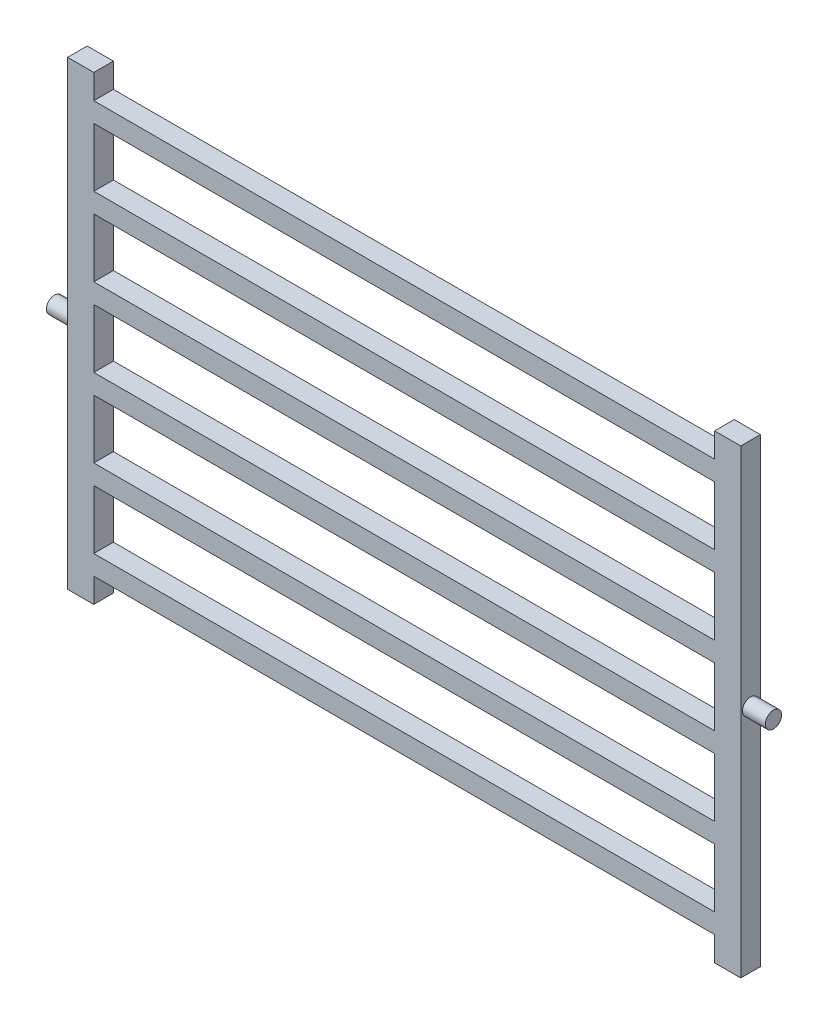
ISO-10303-21;
HEADER;
FILE_DESCRIPTION(('STEP AP214'),'2;1');
FILE_NAME('part.step','',(''),(''),'','','');
FILE_SCHEMA(('AUTOMOTIVE_DESIGN { 1 0 10303 214 1 1 1 1 }'));
ENDSEC;
DATA;
#1=APPLICATION_CONTEXT('core data for automotive mechanical design processes');
#2=APPLICATION_PROTOCOL_DEFINITION('international standard','automotive_design',2000,#1);
#3=PRODUCT_CONTEXT('',#1,'mechanical');
#4=PRODUCT('Part','Part','',(#3));
#5=PRODUCT_RELATED_PRODUCT_CATEGORY('part','',(#4));
#6=PRODUCT_DEFINITION_FORMATION('','',#4);
#7=PRODUCT_DEFINITION_CONTEXT('part definition',#1,'design');
#8=PRODUCT_DEFINITION('design','',#6,#7);
#9=PRODUCT_DEFINITION_SHAPE('','',#8);
#10=(LENGTH_UNIT() NAMED_UNIT(*) SI_UNIT(.MILLI.,.METRE.));
#11=(NAMED_UNIT(*) PLANE_ANGLE_UNIT() SI_UNIT($,.RADIAN.));
#12=(NAMED_UNIT(*) SI_UNIT($,.STERADIAN.) SOLID_ANGLE_UNIT());
#13=UNCERTAINTY_MEASURE_WITH_UNIT(LENGTH_MEASURE(1.E-05),#10,'distance_accuracy_value','');
#14=(GEOMETRIC_REPRESENTATION_CONTEXT(3) GLOBAL_UNCERTAINTY_ASSIGNED_CONTEXT((#13)) GLOBAL_UNIT_ASSIGNED_CONTEXT((#10,
#11,#12)) REPRESENTATION_CONTEXT('',''));
#15=CARTESIAN_POINT('',(0.,0.,0.));
#16=DIRECTION('',(0.,0.,1.));
#17=DIRECTION('',(1.,0.,0.));
#18=AXIS2_PLACEMENT_3D('',#15,#16,#17);
#19=CARTESIAN_POINT('',(205.,158.,8.));
#20=DIRECTION('',(1.,0.,0.));
#21=DIRECTION('',(0.,1.,0.));
#22=AXIS2_PLACEMENT_3D('',#19,#20,#21);
#23=PLANE('',#22);
#24=DIRECTION('',(0.,0.,-1.));
#25=VECTOR('',#24,1.);
#26=CARTESIAN_POINT('',(205.,150.5,8.));
#27=LINE('',#26,#25);
#28=CARTESIAN_POINT('',(205.,150.5,8.));
#29=VERTEX_POINT('',#28);
#30=CARTESIAN_POINT('',(205.,150.5,2.));
#31=VERTEX_POINT('',#30);
#32=EDGE_CURVE('E256',#29,#31,#27,.T.);
#33=ORIENTED_EDGE('',*,*,#32,.F.);
#34=DIRECTION('',(0.,-1.,0.));
#35=VECTOR('',#34,1.);
#36=CARTESIAN_POINT('',(205.,158.,8.));
#37=LINE('',#36,#35);
#38=CARTESIAN_POINT('',(205.,158.,8.));
#39=VERTEX_POINT('',#38);
#40=EDGE_CURVE('E492',#39,#29,#37,.T.);
#41=ORIENTED_EDGE('',*,*,#40,.F.);
#42=DIRECTION('',(0.,0.,-1.));
#43=VECTOR('',#42,1.);
#44=CARTESIAN_POINT('',(205.,158.,8.));
#45=LINE('',#44,#43);
#46=CARTESIAN_POINT('',(205.,158.,2.));
#47=VERTEX_POINT('',#46);
#48=EDGE_CURVE('E283',#39,#47,#45,.T.);
#49=ORIENTED_EDGE('',*,*,#48,.T.);
#50=DIRECTION('',(0.,-1.,0.));
#51=VECTOR('',#50,1.);
#52=CARTESIAN_POINT('',(205.,158.,2.));
#53=LINE('',#52,#51);
#54=EDGE_CURVE('E273',#47,#31,#53,.T.);
#55=ORIENTED_EDGE('',*,*,#54,.T.);
#56=EDGE_LOOP('',(#33,#41,#49,#55));
#57=FACE_BOUND('',#56,.T.);
#58=ADVANCED_FACE('F50',(#57),#23,.F.);
#59=CARTESIAN_POINT('',(15.,158.,8.));
#60=DIRECTION('',(-1.,0.,0.));
#61=DIRECTION('',(0.,-1.,0.));
#62=AXIS2_PLACEMENT_3D('',#59,#60,#61);
#63=PLANE('',#62);
#64=DIRECTION('',(0.,0.,-1.));
#65=VECTOR('',#64,1.);
#66=CARTESIAN_POINT('',(14.9999999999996,144.5,8.));
#67=LINE('',#66,#65);
#68=CARTESIAN_POINT('',(14.9999999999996,144.5,8.));
#69=VERTEX_POINT('',#68);
#70=CARTESIAN_POINT('',(14.9999999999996,144.5,2.));
#71=VERTEX_POINT('',#70);
#72=EDGE_CURVE('E452',#69,#71,#67,.T.);
#73=ORIENTED_EDGE('',*,*,#72,.F.);
#74=DIRECTION('',(0.,1.,0.));
#75=VECTOR('',#74,1.);
#76=CARTESIAN_POINT('',(15.,158.,8.));
#77=LINE('',#76,#75);
#78=CARTESIAN_POINT('',(14.9999999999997,126.5,8.));
#79=VERTEX_POINT('',#78);
#80=EDGE_CURVE('E651',#79,#69,#77,.T.);
#81=ORIENTED_EDGE('',*,*,#80,.F.);
#82=DIRECTION('',(0.,0.,-1.));
#83=VECTOR('',#82,1.);
#84=CARTESIAN_POINT('',(14.9999999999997,126.5,8.));
#85=LINE('',#84,#83);
#86=CARTESIAN_POINT('',(15.,126.5,2.));
#87=VERTEX_POINT('',#86);
#88=EDGE_CURVE('E423',#79,#87,#85,.T.);
#89=ORIENTED_EDGE('',*,*,#88,.T.);
#90=DIRECTION('',(0.,1.,0.));
#91=VECTOR('',#90,1.);
#92=CARTESIAN_POINT('',(15.,158.,2.));
#93=LINE('',#92,#91);
#94=EDGE_CURVE('E595',#87,#71,#93,.T.);
#95=ORIENTED_EDGE('',*,*,#94,.T.);
#96=EDGE_LOOP('',(#73,#81,#89,#95));
#97=FACE_BOUND('',#96,.T.);
#98=ADVANCED_FACE('F657',(#97),#63,.F.);
#99=CARTESIAN_POINT('',(205.,144.5,8.));
#100=VERTEX_POINT('',#99);
#101=CARTESIAN_POINT('',(205.,126.5,8.));
#102=VERTEX_POINT('',#101);
#103=EDGE_CURVE('E498',#100,#102,#37,.T.);
#104=ORIENTED_EDGE('',*,*,#103,.F.);
#105=DIRECTION('',(0.,0.,-1.));
#106=VECTOR('',#105,1.);
#107=CARTESIAN_POINT('',(205.,144.5,8.));
#108=LINE('',#107,#106);
#109=CARTESIAN_POINT('',(205.,144.5,2.));
#110=VERTEX_POINT('',#109);
#111=EDGE_CURVE('E270',#100,#110,#108,.T.);
#112=ORIENTED_EDGE('',*,*,#111,.T.);
#113=CARTESIAN_POINT('',(205.,126.5,2.));
#114=VERTEX_POINT('',#113);
#115=EDGE_CURVE('E289',#110,#114,#53,.T.);
#116=ORIENTED_EDGE('',*,*,#115,.T.);
#117=DIRECTION('',(0.,0.,-1.));
#118=VECTOR('',#117,1.);
#119=CARTESIAN_POINT('',(205.,126.5,8.));
#120=LINE('',#119,#118);
#121=EDGE_CURVE('E429',#102,#114,#120,.T.);
#122=ORIENTED_EDGE('',*,*,#121,.F.);
#123=EDGE_LOOP('',(#104,#112,#116,#122));
#124=FACE_BOUND('',#123,.T.);
#125=ADVANCED_FACE('F667',(#124),#23,.F.);
#126=DIRECTION('',(0.,0.,-1.));
#127=VECTOR('',#126,1.);
#128=CARTESIAN_POINT('',(14.9999999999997,120.5,8.));
#129=LINE('',#128,#127);
#130=CARTESIAN_POINT('',(14.9999999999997,120.5,8.));
#131=VERTEX_POINT('',#130);
#132=CARTESIAN_POINT('',(14.9999999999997,120.5,2.));
#133=VERTEX_POINT('',#132);
#134=EDGE_CURVE('E440',#131,#133,#129,.T.);
#135=ORIENTED_EDGE('',*,*,#134,.F.);
#136=CARTESIAN_POINT('',(14.9999999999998,102.5,8.));
#137=VERTEX_POINT('',#136);
#138=EDGE_CURVE('E647',#137,#131,#77,.T.);
#139=ORIENTED_EDGE('',*,*,#138,.F.);
#140=DIRECTION('',(0.,0.,-1.));
#141=VECTOR('',#140,1.);
#142=CARTESIAN_POINT('',(14.9999999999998,102.5,8.));
#143=LINE('',#142,#141);
#144=CARTESIAN_POINT('',(15.,102.5,2.));
#145=VERTEX_POINT('',#144);
#146=EDGE_CURVE('E393',#137,#145,#143,.T.);
#147=ORIENTED_EDGE('',*,*,#146,.T.);
#148=EDGE_CURVE('E597',#145,#133,#93,.T.);
#149=ORIENTED_EDGE('',*,*,#148,.T.);
#150=EDGE_LOOP('',(#135,#139,#147,#149));
#151=FACE_BOUND('',#150,.T.);
#152=ADVANCED_FACE('F701',(#151),#63,.F.);
#153=CARTESIAN_POINT('',(205.,120.5,8.));
#154=VERTEX_POINT('',#153);
#155=CARTESIAN_POINT('',(205.,102.5,8.));
#156=VERTEX_POINT('',#155);
#157=EDGE_CURVE('E669',#154,#156,#37,.T.);
#158=ORIENTED_EDGE('',*,*,#157,.F.);
#159=DIRECTION('',(0.,0.,-1.));
#160=VECTOR('',#159,1.);
#161=CARTESIAN_POINT('',(205.,120.5,8.));
#162=LINE('',#161,#160);
#163=CARTESIAN_POINT('',(205.,120.5,2.));
#164=VERTEX_POINT('',#163);
#165=EDGE_CURVE('E433',#154,#164,#162,.T.);
#166=ORIENTED_EDGE('',*,*,#165,.T.);
#167=CARTESIAN_POINT('',(205.,102.5,2.));
#168=VERTEX_POINT('',#167);
#169=EDGE_CURVE('E291',#164,#168,#53,.T.);
#170=ORIENTED_EDGE('',*,*,#169,.T.);
#171=DIRECTION('',(0.,0.,-1.));
#172=VECTOR('',#171,1.);
#173=CARTESIAN_POINT('',(205.,102.5,8.));
#174=LINE('',#173,#172);
#175=EDGE_CURVE('E402',#156,#168,#174,.T.);
#176=ORIENTED_EDGE('',*,*,#175,.F.);
#177=EDGE_LOOP('',(#158,#166,#170,#176));
#178=FACE_BOUND('',#177,.T.);
#179=ADVANCED_FACE('F703',(#178),#23,.F.);
#180=DIRECTION('',(0.,0.,-1.));
#181=VECTOR('',#180,1.);
#182=CARTESIAN_POINT('',(14.9999999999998,96.5,8.));
#183=LINE('',#182,#181);
#184=CARTESIAN_POINT('',(14.9999999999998,96.5,8.));
#185=VERTEX_POINT('',#184);
#186=CARTESIAN_POINT('',(14.9999999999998,96.5,2.));
#187=VERTEX_POINT('',#186);
#188=EDGE_CURVE('E406',#185,#187,#183,.T.);
#189=ORIENTED_EDGE('',*,*,#188,.F.);
#190=CARTESIAN_POINT('',(14.9999999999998,78.5,8.));
#191=VERTEX_POINT('',#190);
#192=EDGE_CURVE('E645',#191,#185,#77,.T.);
#193=ORIENTED_EDGE('',*,*,#192,.F.);
#194=DIRECTION('',(0.,0.,-1.));
#195=VECTOR('',#194,1.);
#196=CARTESIAN_POINT('',(14.9999999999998,78.5,8.));
#197=LINE('',#196,#195);
#198=CARTESIAN_POINT('',(15.,78.5,2.));
#199=VERTEX_POINT('',#198);
#200=EDGE_CURVE('E362',#191,#199,#197,.T.);
#201=ORIENTED_EDGE('',*,*,#200,.T.);
#202=EDGE_CURVE('E605',#199,#187,#93,.T.);
#203=ORIENTED_EDGE('',*,*,#202,.T.);
#204=EDGE_LOOP('',(#189,#193,#201,#203));
#205=FACE_BOUND('',#204,.T.);
#206=ADVANCED_FACE('F709',(#205),#63,.F.);
#207=CARTESIAN_POINT('',(205.,96.5,8.));
#208=VERTEX_POINT('',#207);
#209=CARTESIAN_POINT('',(205.,78.5,8.));
#210=VERTEX_POINT('',#209);
#211=EDGE_CURVE('E668',#208,#210,#37,.T.);
#212=ORIENTED_EDGE('',*,*,#211,.F.);
#213=DIRECTION('',(0.,0.,-1.));
#214=VECTOR('',#213,1.);
#215=CARTESIAN_POINT('',(205.,96.5,8.));
#216=LINE('',#215,#214);
#217=CARTESIAN_POINT('',(205.,96.5,2.));
#218=VERTEX_POINT('',#217);
#219=EDGE_CURVE('E403',#208,#218,#216,.T.);
#220=ORIENTED_EDGE('',*,*,#219,.T.);
#221=CARTESIAN_POINT('',(205.,78.5,2.));
#222=VERTEX_POINT('',#221);
#223=EDGE_CURVE('E809',#218,#222,#53,.T.);
#224=ORIENTED_EDGE('',*,*,#223,.T.);
#225=DIRECTION('',(0.,0.,-1.));
#226=VECTOR('',#225,1.);
#227=CARTESIAN_POINT('',(205.,78.5,8.));
#228=LINE('',#227,#226);
#229=EDGE_CURVE('E373',#210,#222,#228,.T.);
#230=ORIENTED_EDGE('',*,*,#229,.F.);
#231=EDGE_LOOP('',(#212,#220,#224,#230));
#232=FACE_BOUND('',#231,.T.);
#233=ADVANCED_FACE('F712',(#232),#23,.F.);
#234=DIRECTION('',(0.,0.,-1.));
#235=VECTOR('',#234,1.);
#236=CARTESIAN_POINT('',(14.9999999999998,72.5,8.));
#237=LINE('',#236,#235);
#238=CARTESIAN_POINT('',(14.9999999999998,72.5,8.));
#239=VERTEX_POINT('',#238);
#240=CARTESIAN_POINT('',(14.9999999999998,72.5,2.));
#241=VERTEX_POINT('',#240);
#242=EDGE_CURVE('E382',#239,#241,#237,.T.);
#243=ORIENTED_EDGE('',*,*,#242,.F.);
#244=CARTESIAN_POINT('',(14.9999999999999,54.5,8.));
#245=VERTEX_POINT('',#244);
#246=EDGE_CURVE('E638',#245,#239,#77,.T.);
#247=ORIENTED_EDGE('',*,*,#246,.F.);
#248=DIRECTION('',(0.,0.,-1.));
#249=VECTOR('',#248,1.);
#250=CARTESIAN_POINT('',(14.9999999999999,54.5,8.));
#251=LINE('',#250,#249);
#252=CARTESIAN_POINT('',(15.,54.5,2.));
#253=VERTEX_POINT('',#252);
#254=EDGE_CURVE('E340',#245,#253,#251,.T.);
#255=ORIENTED_EDGE('',*,*,#254,.T.);
#256=EDGE_CURVE('E608',#253,#241,#93,.T.);
#257=ORIENTED_EDGE('',*,*,#256,.T.);
#258=EDGE_LOOP('',(#243,#247,#255,#257));
#259=FACE_BOUND('',#258,.T.);
#260=ADVANCED_FACE('F713',(#259),#63,.F.);
#261=DIRECTION('',(0.,0.,-1.));
#262=VECTOR('',#261,1.);
#263=CARTESIAN_POINT('',(14.9999999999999,48.5,8.));
#264=LINE('',#263,#262);
#265=CARTESIAN_POINT('',(14.9999999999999,48.5,8.));
#266=VERTEX_POINT('',#265);
#267=CARTESIAN_POINT('',(14.9999999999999,48.5,2.));
#268=VERTEX_POINT('',#267);
#269=EDGE_CURVE('E355',#266,#268,#264,.T.);
#270=ORIENTED_EDGE('',*,*,#269,.F.);
#271=CARTESIAN_POINT('',(15.,30.5,8.));
#272=VERTEX_POINT('',#271);
#273=EDGE_CURVE('E536',#272,#266,#77,.T.);
#274=ORIENTED_EDGE('',*,*,#273,.F.);
#275=DIRECTION('',(0.,0.,-1.));
#276=VECTOR('',#275,1.);
#277=CARTESIAN_POINT('',(15.,30.5,8.));
#278=LINE('',#277,#276);
#279=CARTESIAN_POINT('',(15.,30.5,2.));
#280=VERTEX_POINT('',#279);
#281=EDGE_CURVE('E506',#272,#280,#278,.T.);
#282=ORIENTED_EDGE('',*,*,#281,.T.);
#283=EDGE_CURVE('E551',#280,#268,#93,.T.);
#284=ORIENTED_EDGE('',*,*,#283,.T.);
#285=EDGE_LOOP('',(#270,#274,#282,#284));
#286=FACE_BOUND('',#285,.T.);
#287=ADVANCED_FACE('F625',(#286),#63,.F.);
#288=CARTESIAN_POINT('',(205.,72.5,8.));
#289=VERTEX_POINT('',#288);
#290=CARTESIAN_POINT('',(205.,54.5,8.));
#291=VERTEX_POINT('',#290);
#292=EDGE_CURVE('E672',#289,#291,#37,.T.);
#293=ORIENTED_EDGE('',*,*,#292,.F.);
#294=DIRECTION('',(0.,0.,-1.));
#295=VECTOR('',#294,1.);
#296=CARTESIAN_POINT('',(205.,72.5,8.));
#297=LINE('',#296,#295);
#298=CARTESIAN_POINT('',(205.,72.5,2.));
#299=VERTEX_POINT('',#298);
#300=EDGE_CURVE('E380',#289,#299,#297,.T.);
#301=ORIENTED_EDGE('',*,*,#300,.T.);
#302=CARTESIAN_POINT('',(205.,54.5,2.));
#303=VERTEX_POINT('',#302);
#304=EDGE_CURVE('E304',#299,#303,#53,.T.);
#305=ORIENTED_EDGE('',*,*,#304,.T.);
#306=DIRECTION('',(0.,0.,-1.));
#307=VECTOR('',#306,1.);
#308=CARTESIAN_POINT('',(205.,54.5,8.));
#309=LINE('',#308,#307);
#310=EDGE_CURVE('E343',#291,#303,#309,.T.);
#311=ORIENTED_EDGE('',*,*,#310,.F.);
#312=EDGE_LOOP('',(#293,#301,#305,#311));
#313=FACE_BOUND('',#312,.T.);
#314=ADVANCED_FACE('F718',(#313),#23,.F.);
#315=DIRECTION('',(0.,0.,-1.));
#316=VECTOR('',#315,1.);
#317=CARTESIAN_POINT('',(15.,24.5,8.));
#318=LINE('',#317,#316);
#319=CARTESIAN_POINT('',(15.,24.5,8.));
#320=VERTEX_POINT('',#319);
#321=CARTESIAN_POINT('',(15.,24.5,2.));
#322=VERTEX_POINT('',#321);
#323=EDGE_CURVE('E518',#320,#322,#318,.T.);
#324=ORIENTED_EDGE('',*,*,#323,.F.);
#325=CARTESIAN_POINT('',(15.,17.,8.));
#326=VERTEX_POINT('',#325);
#327=EDGE_CURVE('E534',#326,#320,#77,.T.);
#328=ORIENTED_EDGE('',*,*,#327,.F.);
#329=DIRECTION('',(0.,0.,-1.));
#330=VECTOR('',#329,1.);
#331=CARTESIAN_POINT('',(15.,17.,8.));
#332=LINE('',#331,#330);
#333=CARTESIAN_POINT('',(15.,17.,2.));
#334=VERTEX_POINT('',#333);
#335=EDGE_CURVE('E565',#326,#334,#332,.T.);
#336=ORIENTED_EDGE('',*,*,#335,.T.);
#337=EDGE_CURVE('E548',#334,#322,#93,.T.);
#338=ORIENTED_EDGE('',*,*,#337,.T.);
#339=EDGE_LOOP('',(#324,#328,#336,#338));
#340=FACE_BOUND('',#339,.T.);
#341=ADVANCED_FACE('F576',(#340),#63,.F.);
#342=CARTESIAN_POINT('',(7.,158.,8.));
#343=DIRECTION('',(1.,0.,0.));
#344=DIRECTION('',(0.,0.,-1.));
#345=AXIS2_PLACEMENT_3D('',#342,#343,#344);
#346=PLANE('',#345);
#347=CARTESIAN_POINT('',(7.,87.5,5.));
#348=DIRECTION('',(-1.,0.,0.));
#349=DIRECTION('',(0.,0.,1.));
#350=AXIS2_PLACEMENT_3D('',#347,#348,#349);
#351=CIRCLE('',#350,2.5);
#352=CARTESIAN_POINT('',(7.,87.5,7.5));
#353=VERTEX_POINT('',#352);
#354=EDGE_CURVE('E60',#353,#353,#351,.T.);
#355=ORIENTED_EDGE('',*,*,#354,.F.);
#356=EDGE_LOOP('',(#355));
#357=FACE_BOUND('',#356,.T.);
#358=DIRECTION('',(0.,-1.,0.));
#359=VECTOR('',#358,1.);
#360=CARTESIAN_POINT('',(7.,158.,2.));
#361=LINE('',#360,#359);
#362=CARTESIAN_POINT('',(7.,158.,2.));
#363=VERTEX_POINT('',#362);
#364=CARTESIAN_POINT('',(7.,17.,2.));
#365=VERTEX_POINT('',#364);
#366=EDGE_CURVE('E522',#363,#365,#361,.T.);
#367=ORIENTED_EDGE('',*,*,#366,.T.);
#368=DIRECTION('',(0.,0.,-1.));
#369=VECTOR('',#368,1.);
#370=CARTESIAN_POINT('',(7.,17.,8.));
#371=LINE('',#370,#369);
#372=CARTESIAN_POINT('',(7.,17.,8.));
#373=VERTEX_POINT('',#372);
#374=EDGE_CURVE('E51',#373,#365,#371,.T.);
#375=ORIENTED_EDGE('',*,*,#374,.F.);
#376=DIRECTION('',(0.,-1.,0.));
#377=VECTOR('',#376,1.);
#378=CARTESIAN_POINT('',(7.,158.,8.));
#379=LINE('',#378,#377);
#380=CARTESIAN_POINT('',(7.,158.,8.));
#381=VERTEX_POINT('',#380);
#382=EDGE_CURVE('E524',#381,#373,#379,.T.);
#383=ORIENTED_EDGE('',*,*,#382,.F.);
#384=DIRECTION('',(0.,0.,-1.));
#385=VECTOR('',#384,1.);
#386=CARTESIAN_POINT('',(7.,158.,8.));
#387=LINE('',#386,#385);
#388=EDGE_CURVE('E545',#381,#363,#387,.T.);
#389=ORIENTED_EDGE('',*,*,#388,.T.);
#390=EDGE_LOOP('',(#367,#375,#383,#389));
#391=FACE_BOUND('',#390,.T.);
#392=ADVANCED_FACE('F47',(#357,#391),#346,.F.);
#393=CARTESIAN_POINT('',(7.,17.,8.));
#394=DIRECTION('',(0.,1.,0.));
#395=DIRECTION('',(0.,0.,1.));
#396=AXIS2_PLACEMENT_3D('',#393,#394,#395);
#397=PLANE('',#396);
#398=DIRECTION('',(1.,0.,0.));
#399=VECTOR('',#398,1.);
#400=CARTESIAN_POINT('',(7.,17.,2.));
#401=LINE('',#400,#399);
#402=EDGE_CURVE('E549',#365,#334,#401,.T.);
#403=ORIENTED_EDGE('',*,*,#402,.T.);
#404=ORIENTED_EDGE('',*,*,#335,.F.);
#405=DIRECTION('',(1.,0.,0.));
#406=VECTOR('',#405,1.);
#407=CARTESIAN_POINT('',(7.,17.,8.));
#408=LINE('',#407,#406);
#409=EDGE_CURVE('E528',#373,#326,#408,.T.);
#410=ORIENTED_EDGE('',*,*,#409,.F.);
#411=ORIENTED_EDGE('',*,*,#374,.T.);
#412=EDGE_LOOP('',(#403,#404,#410,#411));
#413=FACE_BOUND('',#412,.T.);
#414=ADVANCED_FACE('F572',(#413),#397,.F.);
#415=CARTESIAN_POINT('',(14.9999999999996,150.5,8.));
#416=VERTEX_POINT('',#415);
#417=CARTESIAN_POINT('',(15.,158.,8.));
#418=VERTEX_POINT('',#417);
#419=EDGE_CURVE('E531',#416,#418,#77,.T.);
#420=ORIENTED_EDGE('',*,*,#419,.F.);
#421=DIRECTION('',(0.,0.,-1.));
#422=VECTOR('',#421,1.);
#423=CARTESIAN_POINT('',(14.9999999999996,150.5,8.));
#424=LINE('',#423,#422);
#425=CARTESIAN_POINT('',(15.,150.5,2.));
#426=VERTEX_POINT('',#425);
#427=EDGE_CURVE('E266',#416,#426,#424,.T.);
#428=ORIENTED_EDGE('',*,*,#427,.T.);
#429=CARTESIAN_POINT('',(15.,158.,2.));
#430=VERTEX_POINT('',#429);
#431=EDGE_CURVE('E280',#426,#430,#93,.T.);
#432=ORIENTED_EDGE('',*,*,#431,.T.);
#433=DIRECTION('',(0.,0.,-1.));
#434=VECTOR('',#433,1.);
#435=CARTESIAN_POINT('',(15.,158.,8.));
#436=LINE('',#435,#434);
#437=EDGE_CURVE('E559',#418,#430,#436,.T.);
#438=ORIENTED_EDGE('',*,*,#437,.F.);
#439=EDGE_LOOP('',(#420,#428,#432,#438));
#440=FACE_BOUND('',#439,.T.);
#441=ADVANCED_FACE('F594',(#440),#63,.F.);
#442=CARTESIAN_POINT('',(7.,158.,8.));
#443=DIRECTION('',(0.,-1.,0.));
#444=DIRECTION('',(0.,0.,-1.));
#445=AXIS2_PLACEMENT_3D('',#442,#443,#444);
#446=PLANE('',#445);
#447=DIRECTION('',(-1.,0.,0.));
#448=VECTOR('',#447,1.);
#449=CARTESIAN_POINT('',(7.,158.,2.));
#450=LINE('',#449,#448);
#451=EDGE_CURVE('E527',#430,#363,#450,.T.);
#452=ORIENTED_EDGE('',*,*,#451,.T.);
#453=ORIENTED_EDGE('',*,*,#388,.F.);
#454=DIRECTION('',(-1.,0.,0.));
#455=VECTOR('',#454,1.);
#456=CARTESIAN_POINT('',(7.,158.,8.));
#457=LINE('',#456,#455);
#458=EDGE_CURVE('E539',#418,#381,#457,.T.);
#459=ORIENTED_EDGE('',*,*,#458,.F.);
#460=ORIENTED_EDGE('',*,*,#437,.T.);
#461=EDGE_LOOP('',(#452,#453,#459,#460));
#462=FACE_BOUND('',#461,.T.);
#463=ADVANCED_FACE('F587',(#462),#446,.F.);
#464=CARTESIAN_POINT('',(0.,0.,8.));
#465=DIRECTION('',(0.,0.,1.));
#466=DIRECTION('',(1.,0.,0.));
#467=AXIS2_PLACEMENT_3D('',#464,#465,#466);
#468=PLANE('',#467);
#469=ORIENTED_EDGE('',*,*,#40,.T.);
#470=DIRECTION('',(-1.,0.,0.));
#471=VECTOR('',#470,1.);
#472=CARTESIAN_POINT('',(14.9999999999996,150.5,8.));
#473=LINE('',#472,#471);
#474=EDGE_CURVE('E261',#29,#416,#473,.T.);
#475=ORIENTED_EDGE('',*,*,#474,.T.);
#476=ORIENTED_EDGE('',*,*,#419,.T.);
#477=ORIENTED_EDGE('',*,*,#458,.T.);
#478=ORIENTED_EDGE('',*,*,#382,.T.);
#479=ORIENTED_EDGE('',*,*,#409,.T.);
#480=ORIENTED_EDGE('',*,*,#327,.T.);
#481=DIRECTION('',(1.,0.,0.));
#482=VECTOR('',#481,1.);
#483=CARTESIAN_POINT('',(15.,24.5,8.));
#484=LINE('',#483,#482);
#485=CARTESIAN_POINT('',(205.,24.5,8.));
#486=VERTEX_POINT('',#485);
#487=EDGE_CURVE('E501',#320,#486,#484,.T.);
#488=ORIENTED_EDGE('',*,*,#487,.T.);
#489=CARTESIAN_POINT('',(205.,17.,8.));
#490=VERTEX_POINT('',#489);
#491=EDGE_CURVE('E494',#486,#490,#37,.T.);
#492=ORIENTED_EDGE('',*,*,#491,.T.);
#493=DIRECTION('',(1.,0.,0.));
#494=VECTOR('',#493,1.);
#495=CARTESIAN_POINT('',(213.,17.,8.));
#496=LINE('',#495,#494);
#497=CARTESIAN_POINT('',(213.,17.,8.));
#498=VERTEX_POINT('',#497);
#499=EDGE_CURVE('E316',#490,#498,#496,.T.);
#500=ORIENTED_EDGE('',*,*,#499,.T.);
#501=DIRECTION('',(0.,1.,0.));
#502=VECTOR('',#501,1.);
#503=CARTESIAN_POINT('',(213.,158.,8.));
#504=LINE('',#503,#502);
#505=CARTESIAN_POINT('',(213.,158.,8.));
#506=VERTEX_POINT('',#505);
#507=EDGE_CURVE('E306',#498,#506,#504,.T.);
#508=ORIENTED_EDGE('',*,*,#507,.T.);
#509=DIRECTION('',(-1.,0.,0.));
#510=VECTOR('',#509,1.);
#511=CARTESIAN_POINT('',(213.,158.,8.));
#512=LINE('',#511,#510);
#513=EDGE_CURVE('E312',#506,#39,#512,.T.);
#514=ORIENTED_EDGE('',*,*,#513,.T.);
#515=EDGE_LOOP('',(#469,#475,#476,#477,#478,#479,#480,#488,#492,#500,#508,#514));
#516=FACE_BOUND('',#515,.T.);
#517=DIRECTION('',(1.,0.,0.));
#518=VECTOR('',#517,1.);
#519=CARTESIAN_POINT('',(14.9999999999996,144.5,8.));
#520=LINE('',#519,#518);
#521=EDGE_CURVE('E276',#69,#100,#520,.T.);
#522=ORIENTED_EDGE('',*,*,#521,.T.);
#523=ORIENTED_EDGE('',*,*,#103,.T.);
#524=DIRECTION('',(-1.,0.,0.));
#525=VECTOR('',#524,1.);
#526=CARTESIAN_POINT('',(14.9999999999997,126.5,8.));
#527=LINE('',#526,#525);
#528=EDGE_CURVE('E420',#102,#79,#527,.T.);
#529=ORIENTED_EDGE('',*,*,#528,.T.);
#530=ORIENTED_EDGE('',*,*,#80,.T.);
#531=EDGE_LOOP('',(#522,#523,#529,#530));
#532=FACE_BOUND('',#531,.T.);
#533=DIRECTION('',(1.,0.,0.));
#534=VECTOR('',#533,1.);
#535=CARTESIAN_POINT('',(14.9999999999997,120.5,8.));
#536=LINE('',#535,#534);
#537=EDGE_CURVE('E412',#131,#154,#536,.T.);
#538=ORIENTED_EDGE('',*,*,#537,.T.);
#539=ORIENTED_EDGE('',*,*,#157,.T.);
#540=DIRECTION('',(-1.,0.,0.));
#541=VECTOR('',#540,1.);
#542=CARTESIAN_POINT('',(14.9999999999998,102.5,8.));
#543=LINE('',#542,#541);
#544=EDGE_CURVE('E388',#156,#137,#543,.T.);
#545=ORIENTED_EDGE('',*,*,#544,.T.);
#546=ORIENTED_EDGE('',*,*,#138,.T.);
#547=EDGE_LOOP('',(#538,#539,#545,#546));
#548=FACE_BOUND('',#547,.T.);
#549=DIRECTION('',(1.,0.,0.));
#550=VECTOR('',#549,1.);
#551=CARTESIAN_POINT('',(14.9999999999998,96.5,8.));
#552=LINE('',#551,#550);
#553=EDGE_CURVE('E387',#185,#208,#552,.T.);
#554=ORIENTED_EDGE('',*,*,#553,.T.);
#555=ORIENTED_EDGE('',*,*,#211,.T.);
#556=DIRECTION('',(-1.,0.,0.));
#557=VECTOR('',#556,1.);
#558=CARTESIAN_POINT('',(14.9999999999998,78.5,8.));
#559=LINE('',#558,#557);
#560=EDGE_CURVE('E365',#210,#191,#559,.T.);
#561=ORIENTED_EDGE('',*,*,#560,.T.);
#562=ORIENTED_EDGE('',*,*,#192,.T.);
#563=EDGE_LOOP('',(#554,#555,#561,#562));
#564=FACE_BOUND('',#563,.T.);
#565=ORIENTED_EDGE('',*,*,#273,.T.);
#566=DIRECTION('',(1.,0.,0.));
#567=VECTOR('',#566,1.);
#568=CARTESIAN_POINT('',(14.9999999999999,48.5,8.));
#569=LINE('',#568,#567);
#570=CARTESIAN_POINT('',(205.,48.5,8.));
#571=VERTEX_POINT('',#570);
#572=EDGE_CURVE('E329',#266,#571,#569,.T.);
#573=ORIENTED_EDGE('',*,*,#572,.T.);
#574=CARTESIAN_POINT('',(205.,30.5,8.));
#575=VERTEX_POINT('',#574);
#576=EDGE_CURVE('E636',#571,#575,#37,.T.);
#577=ORIENTED_EDGE('',*,*,#576,.T.);
#578=DIRECTION('',(-1.,0.,0.));
#579=VECTOR('',#578,1.);
#580=CARTESIAN_POINT('',(15.,30.5,8.));
#581=LINE('',#580,#579);
#582=EDGE_CURVE('E502',#575,#272,#581,.T.);
#583=ORIENTED_EDGE('',*,*,#582,.T.);
#584=EDGE_LOOP('',(#565,#573,#577,#583));
#585=FACE_BOUND('',#584,.T.);
#586=DIRECTION('',(1.,0.,0.));
#587=VECTOR('',#586,1.);
#588=CARTESIAN_POINT('',(14.9999999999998,72.5,8.));
#589=LINE('',#588,#587);
#590=EDGE_CURVE('E356',#239,#289,#589,.T.);
#591=ORIENTED_EDGE('',*,*,#590,.T.);
#592=ORIENTED_EDGE('',*,*,#292,.T.);
#593=DIRECTION('',(-1.,0.,0.));
#594=VECTOR('',#593,1.);
#595=CARTESIAN_POINT('',(14.9999999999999,54.5,8.));
#596=LINE('',#595,#594);
#597=EDGE_CURVE('E333',#291,#245,#596,.T.);
#598=ORIENTED_EDGE('',*,*,#597,.T.);
#599=ORIENTED_EDGE('',*,*,#246,.T.);
#600=EDGE_LOOP('',(#591,#592,#598,#599));
#601=FACE_BOUND('',#600,.T.);
#602=ADVANCED_FACE('F585',(#516,#532,#548,#564,#585,#601),#468,.T.);
#603=CARTESIAN_POINT('',(0.,0.,2.));
#604=DIRECTION('',(0.,0.,1.));
#605=DIRECTION('',(1.,0.,0.));
#606=AXIS2_PLACEMENT_3D('',#603,#604,#605);
#607=PLANE('',#606);
#608=DIRECTION('',(-1.,0.,0.));
#609=VECTOR('',#608,1.);
#610=CARTESIAN_POINT('',(14.9999999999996,150.5,2.));
#611=LINE('',#610,#609);
#612=EDGE_CURVE('E63',#31,#426,#611,.T.);
#613=ORIENTED_EDGE('',*,*,#612,.F.);
#614=ORIENTED_EDGE('',*,*,#54,.F.);
#615=DIRECTION('',(-1.,0.,0.));
#616=VECTOR('',#615,1.);
#617=CARTESIAN_POINT('',(213.,158.,2.));
#618=LINE('',#617,#616);
#619=CARTESIAN_POINT('',(213.,158.,2.));
#620=VERTEX_POINT('',#619);
#621=EDGE_CURVE('E284',#620,#47,#618,.T.);
#622=ORIENTED_EDGE('',*,*,#621,.F.);
#623=DIRECTION('',(0.,1.,0.));
#624=VECTOR('',#623,1.);
#625=CARTESIAN_POINT('',(213.,158.,2.));
#626=LINE('',#625,#624);
#627=CARTESIAN_POINT('',(213.,17.,2.));
#628=VERTEX_POINT('',#627);
#629=EDGE_CURVE('E293',#628,#620,#626,.T.);
#630=ORIENTED_EDGE('',*,*,#629,.F.);
#631=DIRECTION('',(1.,0.,0.));
#632=VECTOR('',#631,1.);
#633=CARTESIAN_POINT('',(213.,17.,2.));
#634=LINE('',#633,#632);
#635=CARTESIAN_POINT('',(205.,17.,2.));
#636=VERTEX_POINT('',#635);
#637=EDGE_CURVE('E300',#636,#628,#634,.T.);
#638=ORIENTED_EDGE('',*,*,#637,.F.);
#639=CARTESIAN_POINT('',(205.,24.5,2.));
#640=VERTEX_POINT('',#639);
#641=EDGE_CURVE('E290',#640,#636,#53,.T.);
#642=ORIENTED_EDGE('',*,*,#641,.F.);
#643=DIRECTION('',(1.,0.,0.));
#644=VECTOR('',#643,1.);
#645=CARTESIAN_POINT('',(15.,24.5,2.));
#646=LINE('',#645,#644);
#647=EDGE_CURVE('E488',#322,#640,#646,.T.);
#648=ORIENTED_EDGE('',*,*,#647,.F.);
#649=ORIENTED_EDGE('',*,*,#337,.F.);
#650=ORIENTED_EDGE('',*,*,#402,.F.);
#651=ORIENTED_EDGE('',*,*,#366,.F.);
#652=ORIENTED_EDGE('',*,*,#451,.F.);
#653=ORIENTED_EDGE('',*,*,#431,.F.);
#654=EDGE_LOOP('',(#613,#614,#622,#630,#638,#642,#648,#649,#650,#651,#652,#653));
#655=FACE_BOUND('',#654,.T.);
#656=DIRECTION('',(-1.,0.,0.));
#657=VECTOR('',#656,1.);
#658=CARTESIAN_POINT('',(14.9999999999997,126.5,2.));
#659=LINE('',#658,#657);
#660=EDGE_CURVE('E416',#114,#87,#659,.T.);
#661=ORIENTED_EDGE('',*,*,#660,.F.);
#662=ORIENTED_EDGE('',*,*,#115,.F.);
#663=DIRECTION('',(1.,0.,0.));
#664=VECTOR('',#663,1.);
#665=CARTESIAN_POINT('',(14.9999999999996,144.5,2.));
#666=LINE('',#665,#664);
#667=EDGE_CURVE('E75',#71,#110,#666,.T.);
#668=ORIENTED_EDGE('',*,*,#667,.F.);
#669=ORIENTED_EDGE('',*,*,#94,.F.);
#670=EDGE_LOOP('',(#661,#662,#668,#669));
#671=FACE_BOUND('',#670,.T.);
#672=DIRECTION('',(-1.,0.,0.));
#673=VECTOR('',#672,1.);
#674=CARTESIAN_POINT('',(14.9999999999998,102.5,2.));
#675=LINE('',#674,#673);
#676=EDGE_CURVE('E386',#168,#145,#675,.T.);
#677=ORIENTED_EDGE('',*,*,#676,.F.);
#678=ORIENTED_EDGE('',*,*,#169,.F.);
#679=DIRECTION('',(1.,0.,0.));
#680=VECTOR('',#679,1.);
#681=CARTESIAN_POINT('',(14.9999999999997,120.5,2.));
#682=LINE('',#681,#680);
#683=EDGE_CURVE('E413',#133,#164,#682,.T.);
#684=ORIENTED_EDGE('',*,*,#683,.F.);
#685=ORIENTED_EDGE('',*,*,#148,.F.);
#686=EDGE_LOOP('',(#677,#678,#684,#685));
#687=FACE_BOUND('',#686,.T.);
#688=DIRECTION('',(-1.,0.,0.));
#689=VECTOR('',#688,1.);
#690=CARTESIAN_POINT('',(14.9999999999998,78.5,2.));
#691=LINE('',#690,#689);
#692=EDGE_CURVE('E363',#222,#199,#691,.T.);
#693=ORIENTED_EDGE('',*,*,#692,.F.);
#694=ORIENTED_EDGE('',*,*,#223,.F.);
#695=DIRECTION('',(1.,0.,0.));
#696=VECTOR('',#695,1.);
#697=CARTESIAN_POINT('',(14.9999999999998,96.5,2.));
#698=LINE('',#697,#696);
#699=EDGE_CURVE('E383',#187,#218,#698,.T.);
#700=ORIENTED_EDGE('',*,*,#699,.F.);
#701=ORIENTED_EDGE('',*,*,#202,.F.);
#702=EDGE_LOOP('',(#693,#694,#700,#701));
#703=FACE_BOUND('',#702,.T.);
#704=DIRECTION('',(1.,0.,0.));
#705=VECTOR('',#704,1.);
#706=CARTESIAN_POINT('',(14.9999999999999,48.5,2.));
#707=LINE('',#706,#705);
#708=CARTESIAN_POINT('',(205.,48.5,2.));
#709=VERTEX_POINT('',#708);
#710=EDGE_CURVE('E327',#268,#709,#707,.T.);
#711=ORIENTED_EDGE('',*,*,#710,.F.);
#712=ORIENTED_EDGE('',*,*,#283,.F.);
#713=DIRECTION('',(-1.,0.,0.));
#714=VECTOR('',#713,1.);
#715=CARTESIAN_POINT('',(15.,30.5,2.));
#716=LINE('',#715,#714);
#717=CARTESIAN_POINT('',(205.,30.5,2.));
#718=VERTEX_POINT('',#717);
#719=EDGE_CURVE('E490',#718,#280,#716,.T.);
#720=ORIENTED_EDGE('',*,*,#719,.F.);
#721=EDGE_CURVE('E298',#709,#718,#53,.T.);
#722=ORIENTED_EDGE('',*,*,#721,.F.);
#723=EDGE_LOOP('',(#711,#712,#720,#722));
#724=FACE_BOUND('',#723,.T.);
#725=ORIENTED_EDGE('',*,*,#304,.F.);
#726=DIRECTION('',(1.,0.,0.));
#727=VECTOR('',#726,1.);
#728=CARTESIAN_POINT('',(14.9999999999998,72.5,2.));
#729=LINE('',#728,#727);
#730=EDGE_CURVE('E357',#241,#299,#729,.T.);
#731=ORIENTED_EDGE('',*,*,#730,.F.);
#732=ORIENTED_EDGE('',*,*,#256,.F.);
#733=DIRECTION('',(-1.,0.,0.));
#734=VECTOR('',#733,1.);
#735=CARTESIAN_POINT('',(14.9999999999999,54.5,2.));
#736=LINE('',#735,#734);
#737=EDGE_CURVE('E335',#303,#253,#736,.T.);
#738=ORIENTED_EDGE('',*,*,#737,.F.);
#739=EDGE_LOOP('',(#725,#731,#732,#738));
#740=FACE_BOUND('',#739,.T.);
#741=ADVANCED_FACE('F271',(#655,#671,#687,#703,#724,#740),#607,.F.);
#742=CARTESIAN_POINT('',(15.,24.5,8.));
#743=DIRECTION('',(0.,1.,0.));
#744=DIRECTION('',(0.,0.,1.));
#745=AXIS2_PLACEMENT_3D('',#742,#743,#744);
#746=PLANE('',#745);
#747=ORIENTED_EDGE('',*,*,#647,.T.);
#748=DIRECTION('',(0.,0.,-1.));
#749=VECTOR('',#748,1.);
#750=CARTESIAN_POINT('',(205.,24.5,8.));
#751=LINE('',#750,#749);
#752=EDGE_CURVE('E520',#486,#640,#751,.T.);
#753=ORIENTED_EDGE('',*,*,#752,.F.);
#754=ORIENTED_EDGE('',*,*,#487,.F.);
#755=ORIENTED_EDGE('',*,*,#323,.T.);
#756=EDGE_LOOP('',(#747,#753,#754,#755));
#757=FACE_BOUND('',#756,.T.);
#758=ADVANCED_FACE('F735',(#757),#746,.F.);
#759=CARTESIAN_POINT('',(15.,30.5,8.));
#760=DIRECTION('',(0.,-1.,0.));
#761=DIRECTION('',(0.,0.,-1.));
#762=AXIS2_PLACEMENT_3D('',#759,#760,#761);
#763=PLANE('',#762);
#764=ORIENTED_EDGE('',*,*,#719,.T.);
#765=ORIENTED_EDGE('',*,*,#281,.F.);
#766=ORIENTED_EDGE('',*,*,#582,.F.);
#767=DIRECTION('',(0.,0.,-1.));
#768=VECTOR('',#767,1.);
#769=CARTESIAN_POINT('',(205.,30.5,8.));
#770=LINE('',#769,#768);
#771=EDGE_CURVE('E514',#575,#718,#770,.T.);
#772=ORIENTED_EDGE('',*,*,#771,.T.);
#773=EDGE_LOOP('',(#764,#765,#766,#772));
#774=FACE_BOUND('',#773,.T.);
#775=ADVANCED_FACE('F726',(#774),#763,.F.);
#776=ORIENTED_EDGE('',*,*,#491,.F.);
#777=ORIENTED_EDGE('',*,*,#752,.T.);
#778=ORIENTED_EDGE('',*,*,#641,.T.);
#779=DIRECTION('',(0.,0.,-1.));
#780=VECTOR('',#779,1.);
#781=CARTESIAN_POINT('',(205.,17.,8.));
#782=LINE('',#781,#780);
#783=EDGE_CURVE('E318',#490,#636,#782,.T.);
#784=ORIENTED_EDGE('',*,*,#783,.F.);
#785=EDGE_LOOP('',(#776,#777,#778,#784));
#786=FACE_BOUND('',#785,.T.);
#787=ADVANCED_FACE('F477',(#786),#23,.F.);
#788=CARTESIAN_POINT('',(213.,158.,8.));
#789=DIRECTION('',(-1.,0.,0.));
#790=DIRECTION('',(0.,-1.,0.));
#791=AXIS2_PLACEMENT_3D('',#788,#789,#790);
#792=PLANE('',#791);
#793=CARTESIAN_POINT('',(213.,87.5,5.));
#794=DIRECTION('',(1.,0.,0.));
#795=DIRECTION('',(0.,1.,0.));
#796=AXIS2_PLACEMENT_3D('',#793,#794,#795);
#797=CIRCLE('',#796,2.5);
#798=CARTESIAN_POINT('',(213.,90.,5.));
#799=VERTEX_POINT('',#798);
#800=EDGE_CURVE('E11',#799,#799,#797,.T.);
#801=ORIENTED_EDGE('',*,*,#800,.F.);
#802=EDGE_LOOP('',(#801));
#803=FACE_BOUND('',#802,.T.);
#804=ORIENTED_EDGE('',*,*,#629,.T.);
#805=DIRECTION('',(0.,0.,-1.));
#806=VECTOR('',#805,1.);
#807=CARTESIAN_POINT('',(213.,158.,8.));
#808=LINE('',#807,#806);
#809=EDGE_CURVE('E323',#506,#620,#808,.T.);
#810=ORIENTED_EDGE('',*,*,#809,.F.);
#811=ORIENTED_EDGE('',*,*,#507,.F.);
#812=DIRECTION('',(0.,0.,-1.));
#813=VECTOR('',#812,1.);
#814=CARTESIAN_POINT('',(213.,17.,8.));
#815=LINE('',#814,#813);
#816=EDGE_CURVE('E317',#498,#628,#815,.T.);
#817=ORIENTED_EDGE('',*,*,#816,.T.);
#818=EDGE_LOOP('',(#804,#810,#811,#817));
#819=FACE_BOUND('',#818,.T.);
#820=ADVANCED_FACE('F473',(#803,#819),#792,.F.);
#821=CARTESIAN_POINT('',(213.,158.,8.));
#822=DIRECTION('',(0.,-1.,0.));
#823=DIRECTION('',(0.,0.,-1.));
#824=AXIS2_PLACEMENT_3D('',#821,#822,#823);
#825=PLANE('',#824);
#826=ORIENTED_EDGE('',*,*,#621,.T.);
#827=ORIENTED_EDGE('',*,*,#48,.F.);
#828=ORIENTED_EDGE('',*,*,#513,.F.);
#829=ORIENTED_EDGE('',*,*,#809,.T.);
#830=EDGE_LOOP('',(#826,#827,#828,#829));
#831=FACE_BOUND('',#830,.T.);
#832=ADVANCED_FACE('F478',(#831),#825,.F.);
#833=ORIENTED_EDGE('',*,*,#576,.F.);
#834=DIRECTION('',(0.,0.,-1.));
#835=VECTOR('',#834,1.);
#836=CARTESIAN_POINT('',(205.,48.5,8.));
#837=LINE('',#836,#835);
#838=EDGE_CURVE('E347',#571,#709,#837,.T.);
#839=ORIENTED_EDGE('',*,*,#838,.T.);
#840=ORIENTED_EDGE('',*,*,#721,.T.);
#841=ORIENTED_EDGE('',*,*,#771,.F.);
#842=EDGE_LOOP('',(#833,#839,#840,#841));
#843=FACE_BOUND('',#842,.T.);
#844=ADVANCED_FACE('F690',(#843),#23,.F.);
#845=CARTESIAN_POINT('',(213.,17.,8.));
#846=DIRECTION('',(0.,1.,0.));
#847=DIRECTION('',(-1.,0.,0.));
#848=AXIS2_PLACEMENT_3D('',#845,#846,#847);
#849=PLANE('',#848);
#850=ORIENTED_EDGE('',*,*,#637,.T.);
#851=ORIENTED_EDGE('',*,*,#816,.F.);
#852=ORIENTED_EDGE('',*,*,#499,.F.);
#853=ORIENTED_EDGE('',*,*,#783,.T.);
#854=EDGE_LOOP('',(#850,#851,#852,#853));
#855=FACE_BOUND('',#854,.T.);
#856=ADVANCED_FACE('F685',(#855),#849,.F.);
#857=CARTESIAN_POINT('',(14.9999999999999,48.5,8.));
#858=DIRECTION('',(0.,1.,0.));
#859=DIRECTION('',(0.,0.,1.));
#860=AXIS2_PLACEMENT_3D('',#857,#858,#859);
#861=PLANE('',#860);
#862=ORIENTED_EDGE('',*,*,#710,.T.);
#863=ORIENTED_EDGE('',*,*,#838,.F.);
#864=ORIENTED_EDGE('',*,*,#572,.F.);
#865=ORIENTED_EDGE('',*,*,#269,.T.);
#866=EDGE_LOOP('',(#862,#863,#864,#865));
#867=FACE_BOUND('',#866,.T.);
#868=ADVANCED_FACE('F635',(#867),#861,.F.);
#869=CARTESIAN_POINT('',(14.9999999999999,54.5,8.));
#870=DIRECTION('',(0.,-1.,0.));
#871=DIRECTION('',(0.,0.,-1.));
#872=AXIS2_PLACEMENT_3D('',#869,#870,#871);
#873=PLANE('',#872);
#874=ORIENTED_EDGE('',*,*,#737,.T.);
#875=ORIENTED_EDGE('',*,*,#254,.F.);
#876=ORIENTED_EDGE('',*,*,#597,.F.);
#877=ORIENTED_EDGE('',*,*,#310,.T.);
#878=EDGE_LOOP('',(#874,#875,#876,#877));
#879=FACE_BOUND('',#878,.T.);
#880=ADVANCED_FACE('F788',(#879),#873,.F.);
#881=CARTESIAN_POINT('',(14.9999999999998,72.5,8.));
#882=DIRECTION('',(0.,1.,0.));
#883=DIRECTION('',(0.,0.,1.));
#884=AXIS2_PLACEMENT_3D('',#881,#882,#883);
#885=PLANE('',#884);
#886=ORIENTED_EDGE('',*,*,#730,.T.);
#887=ORIENTED_EDGE('',*,*,#300,.F.);
#888=ORIENTED_EDGE('',*,*,#590,.F.);
#889=ORIENTED_EDGE('',*,*,#242,.T.);
#890=EDGE_LOOP('',(#886,#887,#888,#889));
#891=FACE_BOUND('',#890,.T.);
#892=ADVANCED_FACE('F789',(#891),#885,.F.);
#893=CARTESIAN_POINT('',(14.9999999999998,78.5,8.));
#894=DIRECTION('',(0.,-1.,0.));
#895=DIRECTION('',(0.,0.,-1.));
#896=AXIS2_PLACEMENT_3D('',#893,#894,#895);
#897=PLANE('',#896);
#898=ORIENTED_EDGE('',*,*,#692,.T.);
#899=ORIENTED_EDGE('',*,*,#200,.F.);
#900=ORIENTED_EDGE('',*,*,#560,.F.);
#901=ORIENTED_EDGE('',*,*,#229,.T.);
#902=EDGE_LOOP('',(#898,#899,#900,#901));
#903=FACE_BOUND('',#902,.T.);
#904=ADVANCED_FACE('F781',(#903),#897,.F.);
#905=CARTESIAN_POINT('',(14.9999999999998,96.5,8.));
#906=DIRECTION('',(0.,1.,0.));
#907=DIRECTION('',(0.,0.,1.));
#908=AXIS2_PLACEMENT_3D('',#905,#906,#907);
#909=PLANE('',#908);
#910=ORIENTED_EDGE('',*,*,#699,.T.);
#911=ORIENTED_EDGE('',*,*,#219,.F.);
#912=ORIENTED_EDGE('',*,*,#553,.F.);
#913=ORIENTED_EDGE('',*,*,#188,.T.);
#914=EDGE_LOOP('',(#910,#911,#912,#913));
#915=FACE_BOUND('',#914,.T.);
#916=ADVANCED_FACE('F779',(#915),#909,.F.);
#917=CARTESIAN_POINT('',(14.9999999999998,102.5,8.));
#918=DIRECTION('',(0.,-1.,0.));
#919=DIRECTION('',(0.,0.,-1.));
#920=AXIS2_PLACEMENT_3D('',#917,#918,#919);
#921=PLANE('',#920);
#922=ORIENTED_EDGE('',*,*,#676,.T.);
#923=ORIENTED_EDGE('',*,*,#146,.F.);
#924=ORIENTED_EDGE('',*,*,#544,.F.);
#925=ORIENTED_EDGE('',*,*,#175,.T.);
#926=EDGE_LOOP('',(#922,#923,#924,#925));
#927=FACE_BOUND('',#926,.T.);
#928=ADVANCED_FACE('F774',(#927),#921,.F.);
#929=CARTESIAN_POINT('',(14.9999999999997,120.5,8.));
#930=DIRECTION('',(0.,1.,0.));
#931=DIRECTION('',(0.,0.,1.));
#932=AXIS2_PLACEMENT_3D('',#929,#930,#931);
#933=PLANE('',#932);
#934=ORIENTED_EDGE('',*,*,#683,.T.);
#935=ORIENTED_EDGE('',*,*,#165,.F.);
#936=ORIENTED_EDGE('',*,*,#537,.F.);
#937=ORIENTED_EDGE('',*,*,#134,.T.);
#938=EDGE_LOOP('',(#934,#935,#936,#937));
#939=FACE_BOUND('',#938,.T.);
#940=ADVANCED_FACE('F769',(#939),#933,.F.);
#941=CARTESIAN_POINT('',(14.9999999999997,126.5,8.));
#942=DIRECTION('',(0.,-1.,0.));
#943=DIRECTION('',(0.,0.,-1.));
#944=AXIS2_PLACEMENT_3D('',#941,#942,#943);
#945=PLANE('',#944);
#946=ORIENTED_EDGE('',*,*,#660,.T.);
#947=ORIENTED_EDGE('',*,*,#88,.F.);
#948=ORIENTED_EDGE('',*,*,#528,.F.);
#949=ORIENTED_EDGE('',*,*,#121,.T.);
#950=EDGE_LOOP('',(#946,#947,#948,#949));
#951=FACE_BOUND('',#950,.T.);
#952=ADVANCED_FACE('F767',(#951),#945,.F.);
#953=CARTESIAN_POINT('',(14.9999999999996,144.5,8.));
#954=DIRECTION('',(0.,1.,0.));
#955=DIRECTION('',(0.,0.,1.));
#956=AXIS2_PLACEMENT_3D('',#953,#954,#955);
#957=PLANE('',#956);
#958=ORIENTED_EDGE('',*,*,#667,.T.);
#959=ORIENTED_EDGE('',*,*,#111,.F.);
#960=ORIENTED_EDGE('',*,*,#521,.F.);
#961=ORIENTED_EDGE('',*,*,#72,.T.);
#962=EDGE_LOOP('',(#958,#959,#960,#961));
#963=FACE_BOUND('',#962,.T.);
#964=ADVANCED_FACE('F662',(#963),#957,.F.);
#965=CARTESIAN_POINT('',(14.9999999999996,150.5,8.));
#966=DIRECTION('',(0.,-1.,0.));
#967=DIRECTION('',(0.,0.,-1.));
#968=AXIS2_PLACEMENT_3D('',#965,#966,#967);
#969=PLANE('',#968);
#970=ORIENTED_EDGE('',*,*,#612,.T.);
#971=ORIENTED_EDGE('',*,*,#427,.F.);
#972=ORIENTED_EDGE('',*,*,#474,.F.);
#973=ORIENTED_EDGE('',*,*,#32,.T.);
#974=EDGE_LOOP('',(#970,#971,#972,#973));
#975=FACE_BOUND('',#974,.T.);
#976=ADVANCED_FACE('F258',(#975),#969,.F.);
#977=CARTESIAN_POINT('',(0.,87.5,5.));
#978=DIRECTION('',(1.,0.,0.));
#979=DIRECTION('',(0.,0.,-1.));
#980=AXIS2_PLACEMENT_3D('',#977,#978,#979);
#981=CYLINDRICAL_SURFACE('',#980,2.5);
#982=CARTESIAN_POINT('',(0.,87.5,5.));
#983=DIRECTION('',(-1.,0.,0.));
#984=DIRECTION('',(0.,0.,1.));
#985=AXIS2_PLACEMENT_3D('',#982,#983,#984);
#986=CIRCLE('',#985,2.5);
#987=CARTESIAN_POINT('',(0.,87.5,7.5));
#988=VERTEX_POINT('',#987);
#989=EDGE_CURVE('E451',#988,#988,#986,.T.);
#990=ORIENTED_EDGE('',*,*,#989,.F.);
#991=EDGE_LOOP('',(#990));
#992=FACE_BOUND('',#991,.T.);
#993=ORIENTED_EDGE('',*,*,#354,.T.);
#994=EDGE_LOOP('',(#993));
#995=FACE_BOUND('',#994,.T.);
#996=ADVANCED_FACE('F756',(#992,#995),#981,.T.);
#997=CARTESIAN_POINT('',(0.,87.5,5.));
#998=DIRECTION('',(-1.,0.,0.));
#999=DIRECTION('',(0.,0.,1.));
#1000=AXIS2_PLACEMENT_3D('',#997,#998,#999);
#1001=PLANE('',#1000);
#1002=ORIENTED_EDGE('',*,*,#989,.T.);
#1003=EDGE_LOOP('',(#1002));
#1004=FACE_BOUND('',#1003,.T.);
#1005=ADVANCED_FACE('F472',(#1004),#1001,.T.);
#1006=CARTESIAN_POINT('',(220.,87.5,5.));
#1007=DIRECTION('',(-1.,0.,0.));
#1008=DIRECTION('',(0.,-1.,0.));
#1009=AXIS2_PLACEMENT_3D('',#1006,#1007,#1008);
#1010=CYLINDRICAL_SURFACE('',#1009,2.5);
#1011=CARTESIAN_POINT('',(220.,87.5,5.));
#1012=DIRECTION('',(1.,0.,0.));
#1013=DIRECTION('',(0.,1.,0.));
#1014=AXIS2_PLACEMENT_3D('',#1011,#1012,#1013);
#1015=CIRCLE('',#1014,2.5);
#1016=CARTESIAN_POINT('',(220.,90.,5.));
#1017=VERTEX_POINT('',#1016);
#1018=EDGE_CURVE('E459',#1017,#1017,#1015,.T.);
#1019=ORIENTED_EDGE('',*,*,#1018,.F.);
#1020=EDGE_LOOP('',(#1019));
#1021=FACE_BOUND('',#1020,.T.);
#1022=ORIENTED_EDGE('',*,*,#800,.T.);
#1023=EDGE_LOOP('',(#1022));
#1024=FACE_BOUND('',#1023,.T.);
#1025=ADVANCED_FACE('F466',(#1021,#1024),#1010,.T.);
#1026=CARTESIAN_POINT('',(220.,87.5,5.));
#1027=DIRECTION('',(1.,0.,0.));
#1028=DIRECTION('',(0.,1.,0.));
#1029=AXIS2_PLACEMENT_3D('',#1026,#1027,#1028);
#1030=PLANE('',#1029);
#1031=ORIENTED_EDGE('',*,*,#1018,.T.);
#1032=EDGE_LOOP('',(#1031));
#1033=FACE_BOUND('',#1032,.T.);
#1034=ADVANCED_FACE('F467',(#1033),#1030,.T.);
#1035=CLOSED_SHELL('',(#58,#98,#125,#152,#179,#206,#233,#260,#287,#314,#341,#392,#414,#441,#463,
#602,#741,#758,#775,#787,#820,#832,#844,#856,#868,#880,#892,#904,#916,#928,#940,#952,#964,#976,
#996,#1005,#1025,#1034));
#1036=MANIFOLD_SOLID_BREP('B2',#1035);
#1037=ADVANCED_BREP_SHAPE_REPRESENTATION('',(#18,#1036),#14);
#1038=SHAPE_DEFINITION_REPRESENTATION(#9,#1037);
ENDSEC;
END-ISO-10303-21;
